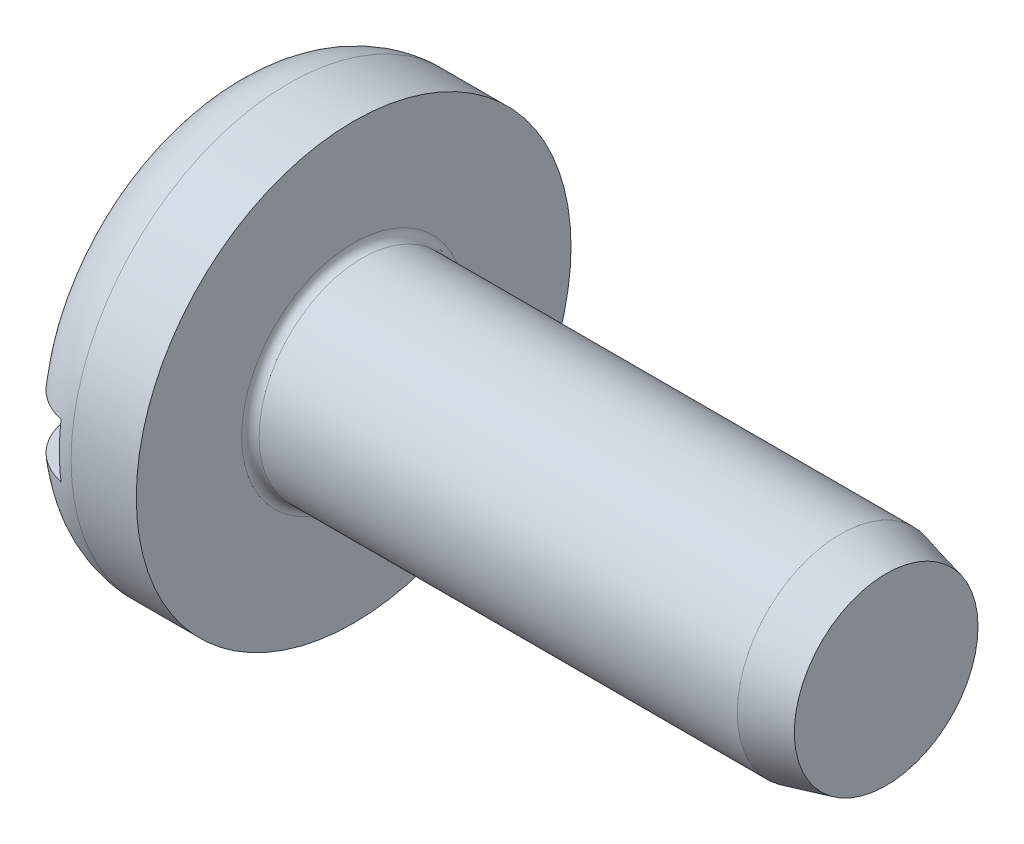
ISO-10303-21;
HEADER;
FILE_DESCRIPTION(('STEP AP214'),'2;1');
FILE_NAME('part.step','',(''),(''),'','','');
FILE_SCHEMA(('AUTOMOTIVE_DESIGN { 1 0 10303 214 1 1 1 1 }'));
ENDSEC;
DATA;
#1=APPLICATION_CONTEXT('core data for automotive mechanical design processes');
#2=APPLICATION_PROTOCOL_DEFINITION('international standard','automotive_design',2000,#1);
#3=PRODUCT_CONTEXT('',#1,'mechanical');
#4=PRODUCT('Part','Part','',(#3));
#5=PRODUCT_RELATED_PRODUCT_CATEGORY('part','',(#4));
#6=PRODUCT_DEFINITION_FORMATION('','',#4);
#7=PRODUCT_DEFINITION_CONTEXT('part definition',#1,'design');
#8=PRODUCT_DEFINITION('design','',#6,#7);
#9=PRODUCT_DEFINITION_SHAPE('','',#8);
#10=(LENGTH_UNIT() NAMED_UNIT(*) SI_UNIT(.MILLI.,.METRE.));
#11=(NAMED_UNIT(*) PLANE_ANGLE_UNIT() SI_UNIT($,.RADIAN.));
#12=(NAMED_UNIT(*) SI_UNIT($,.STERADIAN.) SOLID_ANGLE_UNIT());
#13=UNCERTAINTY_MEASURE_WITH_UNIT(LENGTH_MEASURE(1.E-05),#10,'distance_accuracy_value','');
#14=(GEOMETRIC_REPRESENTATION_CONTEXT(3) GLOBAL_UNCERTAINTY_ASSIGNED_CONTEXT((#13)) GLOBAL_UNIT_ASSIGNED_CONTEXT((#10,
#11,#12)) REPRESENTATION_CONTEXT('',''));
#15=CARTESIAN_POINT('',(0.,0.,0.));
#16=DIRECTION('',(0.,0.,1.));
#17=DIRECTION('',(1.,0.,0.));
#18=AXIS2_PLACEMENT_3D('',#15,#16,#17);
#19=CARTESIAN_POINT('',(-65.8851955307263,0.,0.));
#20=DIRECTION('',(-1.,0.,0.));
#21=DIRECTION('',(0.,0.,1.));
#22=AXIS2_PLACEMENT_3D('',#19,#20,#21);
#23=CYLINDRICAL_SURFACE('',#22,4.75);
#24=CARTESIAN_POINT('',(28.4,0.,0.));
#25=DIRECTION('',(1.,0.,0.));
#26=DIRECTION('',(0.,0.,-1.));
#27=AXIS2_PLACEMENT_3D('',#24,#25,#26);
#28=CIRCLE('',#27,4.75);
#29=CARTESIAN_POINT('',(28.4,0.,-4.75));
#30=VERTEX_POINT('',#29);
#31=EDGE_CURVE('E156',#30,#30,#28,.T.);
#32=ORIENTED_EDGE('',*,*,#31,.F.);
#33=EDGE_LOOP('',(#32));
#34=FACE_BOUND('',#33,.T.);
#35=CARTESIAN_POINT('',(6.4,0.,0.));
#36=DIRECTION('',(-1.,0.,0.));
#37=DIRECTION('',(0.,0.,1.));
#38=AXIS2_PLACEMENT_3D('',#35,#36,#37);
#39=CIRCLE('',#38,4.75);
#40=CARTESIAN_POINT('',(6.4,0.,4.75));
#41=VERTEX_POINT('',#40);
#42=EDGE_CURVE('E12',#41,#41,#39,.F.);
#43=ORIENTED_EDGE('',*,*,#42,.T.);
#44=EDGE_LOOP('',(#43));
#45=FACE_BOUND('',#44,.T.);
#46=ADVANCED_FACE('F38',(#34,#45),#23,.T.);
#47=CARTESIAN_POINT('',(0.,7.,0.));
#48=DIRECTION('',(1.,0.,0.));
#49=DIRECTION('',(0.,0.,-1.));
#50=AXIS2_PLACEMENT_3D('',#47,#48,#49);
#51=PLANE('',#50);
#52=CARTESIAN_POINT('',(0.,0.,0.));
#53=DIRECTION('',(-1.,0.,0.));
#54=DIRECTION('',(0.,0.,1.));
#55=AXIS2_PLACEMENT_3D('',#52,#53,#54);
#56=CIRCLE('',#55,7.00000000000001);
#57=CARTESIAN_POINT('',(0.,1.25,6.88748865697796));
#58=VERTEX_POINT('',#57);
#59=CARTESIAN_POINT('',(0.,1.25,-6.88748865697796));
#60=VERTEX_POINT('',#59);
#61=EDGE_CURVE('E165',#58,#60,#56,.T.);
#62=ORIENTED_EDGE('',*,*,#61,.T.);
#63=DIRECTION('',(0.,0.,1.));
#64=VECTOR('',#63,1.);
#65=CARTESIAN_POINT('',(0.,1.25,0.));
#66=LINE('',#65,#64);
#67=EDGE_CURVE('E180',#60,#58,#66,.T.);
#68=ORIENTED_EDGE('',*,*,#67,.T.);
#69=EDGE_LOOP('',(#62,#68));
#70=FACE_BOUND('',#69,.T.);
#71=ADVANCED_FACE('F127',(#70),#51,.F.);
#72=CARTESIAN_POINT('',(6.,4.74999999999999,0.));
#73=DIRECTION('',(-1.,0.,0.));
#74=DIRECTION('',(0.,0.,1.));
#75=AXIS2_PLACEMENT_3D('',#72,#73,#74);
#76=PLANE('',#75);
#77=CARTESIAN_POINT('',(6.,0.,0.));
#78=DIRECTION('',(-1.,0.,0.));
#79=DIRECTION('',(0.,0.,1.));
#80=AXIS2_PLACEMENT_3D('',#77,#78,#79);
#81=CIRCLE('',#80,5.15);
#82=CARTESIAN_POINT('',(6.,0.,5.15));
#83=VERTEX_POINT('',#82);
#84=EDGE_CURVE('E46',#83,#83,#81,.T.);
#85=ORIENTED_EDGE('',*,*,#84,.T.);
#86=EDGE_LOOP('',(#85));
#87=FACE_BOUND('',#86,.T.);
#88=CARTESIAN_POINT('',(6.00000000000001,0.,0.));
#89=DIRECTION('',(-1.,0.,0.));
#90=DIRECTION('',(0.,0.,1.));
#91=AXIS2_PLACEMENT_3D('',#88,#89,#90);
#92=CIRCLE('',#91,10.);
#93=CARTESIAN_POINT('',(6.00000000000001,0.,10.));
#94=VERTEX_POINT('',#93);
#95=EDGE_CURVE('E169',#94,#94,#92,.T.);
#96=ORIENTED_EDGE('',*,*,#95,.F.);
#97=EDGE_LOOP('',(#96));
#98=FACE_BOUND('',#97,.T.);
#99=ADVANCED_FACE('F134',(#87,#98),#76,.F.);
#100=CARTESIAN_POINT('',(-65.8851955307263,0.,0.));
#101=DIRECTION('',(-1.,0.,0.));
#102=DIRECTION('',(0.,0.,1.));
#103=AXIS2_PLACEMENT_3D('',#100,#101,#102);
#104=CYLINDRICAL_SURFACE('',#103,10.);
#105=CARTESIAN_POINT('',(3.,0.,0.));
#106=DIRECTION('',(-1.,0.,0.));
#107=DIRECTION('',(0.,0.,1.));
#108=AXIS2_PLACEMENT_3D('',#105,#106,#107);
#109=CIRCLE('',#108,10.);
#110=CARTESIAN_POINT('',(3.,0.,10.));
#111=VERTEX_POINT('',#110);
#112=EDGE_CURVE('E166',#111,#111,#109,.T.);
#113=ORIENTED_EDGE('',*,*,#112,.F.);
#114=EDGE_LOOP('',(#113));
#115=FACE_BOUND('',#114,.T.);
#116=ORIENTED_EDGE('',*,*,#95,.T.);
#117=EDGE_LOOP('',(#116));
#118=FACE_BOUND('',#117,.T.);
#119=ADVANCED_FACE('F132',(#115,#118),#104,.T.);
#120=CARTESIAN_POINT('',(3.,0.,0.));
#121=DIRECTION('',(-1.,0.,0.));
#122=DIRECTION('',(0.,0.,1.));
#123=AXIS2_PLACEMENT_3D('',#120,#121,#122);
#124=TOROIDAL_SURFACE('',#123,7.00000000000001,3.);
#125=CARTESIAN_POINT('',(2.4,0.,0.));
#126=DIRECTION('',(1.,0.,0.));
#127=DIRECTION('',(0.,0.,-1.));
#128=AXIS2_PLACEMENT_3D('',#125,#126,#127);
#129=CIRCLE('',#128,9.93938769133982);
#130=CARTESIAN_POINT('',(2.4,-1.25,-9.86047299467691));
#131=VERTEX_POINT('',#130);
#132=CARTESIAN_POINT('',(2.4,1.24999999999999,-9.86047299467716));
#133=VERTEX_POINT('',#132);
#134=EDGE_CURVE('E80',#131,#133,#129,.T.);
#135=ORIENTED_EDGE('',*,*,#134,.T.);
#136=CARTESIAN_POINT('',(1.34000910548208,1.24999999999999,-9.4162801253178));
#137=CARTESIAN_POINT('',(1.19938482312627,1.24999999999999,-9.32203535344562));
#138=CARTESIAN_POINT('',(1.06666473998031,1.24999999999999,-9.21576107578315));
#139=CARTESIAN_POINT('',(0.8209025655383,1.24999999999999,-8.98228972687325));
#140=CARTESIAN_POINT('',(0.707886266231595,1.24999999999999,-8.85506564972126));
#141=CARTESIAN_POINT('',(0.50486661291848,1.25,-8.58358751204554));
#142=CARTESIAN_POINT('',(0.414842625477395,1.25,-8.43934889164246));
#143=CARTESIAN_POINT('',(0.260103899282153,1.25,-8.13794333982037));
#144=CARTESIAN_POINT('',(0.195382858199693,1.25,-7.98077963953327));
#145=CARTESIAN_POINT('',(0.0924273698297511,1.25,-7.65663836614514));
#146=CARTESIAN_POINT('',(0.0544064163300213,1.25,-7.48959301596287));
#147=CARTESIAN_POINT('',(0.00653869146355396,1.25,-7.15151084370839));
#148=CARTESIAN_POINT('',(-0.00330508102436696,1.25,-6.98047359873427));
#149=CARTESIAN_POINT('',(0.00531125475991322,1.25,-6.63677787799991));
#150=CARTESIAN_POINT('',(0.0241596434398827,1.25,-6.46412915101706));
#151=CARTESIAN_POINT('',(0.0901670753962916,1.25,-6.12433094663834));
#152=CARTESIAN_POINT('',(0.137328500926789,1.25,-5.95718193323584));
#153=CARTESIAN_POINT('',(0.259379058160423,1.25,-5.6307192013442));
#154=CARTESIAN_POINT('',(0.334638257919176,1.25,-5.47154375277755));
#155=CARTESIAN_POINT('',(0.510681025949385,1.25,-5.16797482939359));
#156=CARTESIAN_POINT('',(0.611466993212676,1.25,-5.02358274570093));
#157=CARTESIAN_POINT('',(0.836398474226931,1.24999999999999,-4.75312345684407));
#158=CARTESIAN_POINT('',(0.960651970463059,1.24999999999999,-4.62714593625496));
#159=CARTESIAN_POINT('',(1.22890706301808,1.24999999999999,-4.39829870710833));
#160=CARTESIAN_POINT('',(1.37290756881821,1.24999999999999,-4.2954277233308));
#161=CARTESIAN_POINT('',(1.67379323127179,1.24999999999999,-4.11816697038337));
#162=CARTESIAN_POINT('',(1.83037804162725,1.24999999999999,-4.04326844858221));
#163=CARTESIAN_POINT('',(2.15428315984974,1.24999999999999,-3.92221914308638));
#164=CARTESIAN_POINT('',(2.32159933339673,1.24999999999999,-3.87605736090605));
#165=CARTESIAN_POINT('',(2.65428345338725,1.24999999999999,-3.81591452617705));
#166=CARTESIAN_POINT('',(2.81941113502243,1.24999999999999,-3.80060236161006));
#167=CARTESIAN_POINT('',(3.14980632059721,1.24999999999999,-3.79882284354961));
#168=CARTESIAN_POINT('',(3.31507379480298,1.24999999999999,-3.81235041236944));
#169=CARTESIAN_POINT('',(3.63619181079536,1.24999999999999,-3.86683910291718));
#170=CARTESIAN_POINT('',(3.7921764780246,1.24999999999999,-3.90701713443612));
#171=CARTESIAN_POINT('',(4.09543301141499,1.24999999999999,-4.01241024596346));
#172=CARTESIAN_POINT('',(4.24270375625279,1.24999999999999,-4.0776285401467));
#173=CARTESIAN_POINT('',(4.52808379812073,1.24999999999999,-4.23255845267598));
#174=CARTESIAN_POINT('',(4.66590822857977,1.24999999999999,-4.32279384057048));
#175=CARTESIAN_POINT('',(4.92530718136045,1.24999999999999,-4.52418568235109));
#176=CARTESIAN_POINT('',(5.04687848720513,1.24999999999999,-4.63534626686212));
#177=CARTESIAN_POINT('',(5.27593756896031,1.24999999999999,-4.88081695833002));
#178=CARTESIAN_POINT('',(5.38255824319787,1.24999999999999,-5.01593690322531));
#179=CARTESIAN_POINT('',(5.57228450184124,1.24999999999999,-5.30178997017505));
#180=CARTESIAN_POINT('',(5.65538672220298,1.24999999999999,-5.45252532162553));
#181=CARTESIAN_POINT('',(5.79766427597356,1.24999999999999,-5.76952816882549));
#182=CARTESIAN_POINT('',(5.8561791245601,1.24999999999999,-5.93609268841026));
#183=CARTESIAN_POINT('',(5.94441985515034,1.24999999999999,-6.27668772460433));
#184=CARTESIAN_POINT('',(5.97414513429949,1.24999999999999,-6.45071839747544));
#185=CARTESIAN_POINT('',(6.00377819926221,1.24999999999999,-6.80129990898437));
#186=CARTESIAN_POINT('',(6.00368812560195,1.24999999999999,-6.9778505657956));
#187=CARTESIAN_POINT('',(5.9734732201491,1.24999999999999,-7.3283682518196));
#188=CARTESIAN_POINT('',(5.94335011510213,1.24999999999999,-7.50233542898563));
#189=CARTESIAN_POINT('',(5.85430026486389,1.24999999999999,-7.84039370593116));
#190=CARTESIAN_POINT('',(5.79574114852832,1.24999999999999,-8.00458161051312));
#191=CARTESIAN_POINT('',(5.65149606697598,1.24999999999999,-8.32057883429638));
#192=CARTESIAN_POINT('',(5.56581209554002,1.24999999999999,-8.4723890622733));
#193=CARTESIAN_POINT('',(5.3710824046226,1.24999999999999,-8.75703011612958));
#194=CARTESIAN_POINT('',(5.2623865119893,1.24999999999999,-8.89010030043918));
#195=CARTESIAN_POINT('',(5.02396443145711,1.24999999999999,-9.13583952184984));
#196=CARTESIAN_POINT('',(4.89423955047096,1.24999999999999,-9.24850982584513));
#197=CARTESIAN_POINT('',(4.61903789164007,1.24999999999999,-9.44892981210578));
#198=CARTESIAN_POINT('',(4.47375566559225,1.24999999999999,-9.53694669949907));
#199=CARTESIAN_POINT('',(4.1703991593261,1.24999999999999,-9.68712710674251));
#200=CARTESIAN_POINT('',(4.0123259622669,1.24999999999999,-9.74929281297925));
#201=CARTESIAN_POINT('',(3.68914000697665,1.24999999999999,-9.84556612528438));
#202=CARTESIAN_POINT('',(3.5240883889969,1.24999999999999,-9.87987908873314));
#203=CARTESIAN_POINT('',(3.19051750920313,1.24999999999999,-9.92021027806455));
#204=CARTESIAN_POINT('',(3.02199745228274,1.24999999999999,-9.92622194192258));
#205=CARTESIAN_POINT('',(2.68685940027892,1.24999999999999,-9.90978915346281));
#206=CARTESIAN_POINT('',(2.52023730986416,1.24999999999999,-9.88742706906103));
#207=CARTESIAN_POINT('',(2.19326187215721,1.24999999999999,-9.81505031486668));
#208=CARTESIAN_POINT('',(2.03290098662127,1.24999999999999,-9.7650700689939));
#209=CARTESIAN_POINT('',(1.78372332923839,1.24999999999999,-9.66376463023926));
#210=CARTESIAN_POINT('',(1.69148740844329,1.24999999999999,-9.62063518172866));
#211=CARTESIAN_POINT('',(1.51188579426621,1.24999999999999,-9.52521206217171));
#212=CARTESIAN_POINT('',(1.42452008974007,1.24999999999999,-9.47291841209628));
#213=CARTESIAN_POINT('',(1.34000910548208,1.24999999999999,-9.4162801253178));
#214=B_SPLINE_CURVE_WITH_KNOTS('',3,(#136,#137,#138,#139,#140,#141,#142,#143,#144,#145,#146,
#147,#148,#149,#150,#151,#152,#153,#154,#155,#156,#157,#158,#159,#160,#161,#162,#163,#164,#165,
#166,#167,#168,#169,#170,#171,#172,#173,#174,#175,#176,#177,#178,#179,#180,#181,#182,#183,#184,
#185,#186,#187,#188,#189,#190,#191,#192,#193,#194,#195,#196,#197,#198,#199,#200,#201,#202,#203,
#204,#205,#206,#207,#208,#209,#210,#211,#212,#213),.UNSPECIFIED.,.T.,.F.,(4,2,2,2,2,2,2,2,2,2,2,
2,2,2,2,2,2,2,2,2,2,2,2,2,2,2,2,2,2,2,2,2,2,2,2,2,2,2,4),(0.,0.507477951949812,1.01561527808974,
1.52329498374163,2.03084815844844,2.54241488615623,3.05403605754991,3.57264261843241,
4.09129282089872,4.61702989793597,5.14281640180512,5.67108393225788,6.19932230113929,
6.71742203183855,7.23532334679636,7.73035356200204,8.22529662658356,8.70630500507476,
9.18737514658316,9.67939636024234,10.1715148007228,10.6855254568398,11.199609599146,
11.7267355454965,12.2538725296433,12.7809716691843,13.3080405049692,13.8284696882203,
14.3488606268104,14.8618456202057,15.3747987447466,15.8819557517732,16.3890698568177,
16.8924101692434,17.3958671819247,17.8978660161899,18.3992405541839,18.7042203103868,
19.0091993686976),.UNSPECIFIED.);
#215=EDGE_CURVE('E100',#133,#60,#214,.T.);
#216=ORIENTED_EDGE('',*,*,#215,.T.);
#217=ORIENTED_EDGE('',*,*,#61,.F.);
#218=CARTESIAN_POINT('',(1.33942751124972,1.24999999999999,4.32446622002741));
#219=CARTESIAN_POINT('',(1.19606436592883,1.24999999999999,4.4236587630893));
#220=CARTESIAN_POINT('',(1.06113411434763,1.24999999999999,4.53531090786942));
#221=CARTESIAN_POINT('',(0.811850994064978,1.24999999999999,4.77984923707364));
#222=CARTESIAN_POINT('',(0.697533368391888,1.25,4.91277106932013));
#223=CARTESIAN_POINT('',(0.492776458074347,1.25,5.19562467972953));
#224=CARTESIAN_POINT('',(0.402305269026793,1.25,5.34553334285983));
#225=CARTESIAN_POINT('',(0.247526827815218,1.25,5.65822119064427));
#226=CARTESIAN_POINT('',(0.183209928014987,1.25,5.82099560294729));
#227=CARTESIAN_POINT('',(0.0819775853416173,1.25,6.15682052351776));
#228=CARTESIAN_POINT('',(0.0453706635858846,1.25,6.32996421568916));
#229=CARTESIAN_POINT('',(0.00194678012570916,1.25,6.67996793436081));
#230=CARTESIAN_POINT('',(-0.00486855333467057,1.25,6.8568281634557));
#231=CARTESIAN_POINT('',(0.0116532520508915,1.25,7.20797093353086));
#232=CARTESIAN_POINT('',(0.034791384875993,1.25,7.38226278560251));
#233=CARTESIAN_POINT('',(0.110430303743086,1.25,7.72435802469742));
#234=CARTESIAN_POINT('',(0.16292887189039,1.25,7.89216190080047));
#235=CARTESIAN_POINT('',(0.295001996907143,1.25,8.21398383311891));
#236=CARTESIAN_POINT('',(0.374183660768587,1.25,8.36816312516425));
#237=CARTESIAN_POINT('',(0.557644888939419,1.25,8.66078951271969));
#238=CARTESIAN_POINT('',(0.661922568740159,1.25,8.79923778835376));
#239=CARTESIAN_POINT('',(0.891090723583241,1.24999999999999,9.05452042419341));
#240=CARTESIAN_POINT('',(1.01568660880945,1.24999999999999,9.17161928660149));
#241=CARTESIAN_POINT('',(1.28293788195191,1.24999999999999,9.38298488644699));
#242=CARTESIAN_POINT('',(1.42559227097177,1.24999999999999,9.47725288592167));
#243=CARTESIAN_POINT('',(1.72339085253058,1.24999999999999,9.63933556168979));
#244=CARTESIAN_POINT('',(1.8783986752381,1.24999999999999,9.70740086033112));
#245=CARTESIAN_POINT('',(2.19768418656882,1.24999999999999,9.8163693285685));
#246=CARTESIAN_POINT('',(2.36196153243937,1.24999999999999,9.85727350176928));
#247=CARTESIAN_POINT('',(2.69410004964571,1.24999999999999,9.9105516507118));
#248=CARTESIAN_POINT('',(2.86193495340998,1.24999999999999,9.92308949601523));
#249=CARTESIAN_POINT('',(3.19732041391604,1.24999999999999,9.91975041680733));
#250=CARTESIAN_POINT('',(3.36487097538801,1.24999999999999,9.90387396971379));
#251=CARTESIAN_POINT('',(3.69459763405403,1.24999999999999,9.84423178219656));
#252=CARTESIAN_POINT('',(3.8567834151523,1.24999999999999,9.80051954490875));
#253=CARTESIAN_POINT('',(4.17153333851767,1.24999999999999,9.68653492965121));
#254=CARTESIAN_POINT('',(4.3240974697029,1.24999999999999,9.6162625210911));
#255=CARTESIAN_POINT('',(4.61559532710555,1.24999999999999,9.45105008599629));
#256=CARTESIAN_POINT('',(4.7545034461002,1.24999999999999,9.35606489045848));
#257=CARTESIAN_POINT('',(5.01451254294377,1.24999999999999,9.14424314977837));
#258=CARTESIAN_POINT('',(5.13561317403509,1.24999999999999,9.02740617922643));
#259=CARTESIAN_POINT('',(5.35733296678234,1.24999999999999,8.77451918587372));
#260=CARTESIAN_POINT('',(5.45783251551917,1.24999999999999,8.63836431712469));
#261=CARTESIAN_POINT('',(5.63479490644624,1.24999999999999,8.35124620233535));
#262=CARTESIAN_POINT('',(5.71125681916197,1.24999999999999,8.20028238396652));
#263=CARTESIAN_POINT('',(5.83878957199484,1.24999999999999,7.88630563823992));
#264=CARTESIAN_POINT('',(5.88961083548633,1.24999999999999,7.72319136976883));
#265=CARTESIAN_POINT('',(5.96353241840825,1.24999999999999,7.39080308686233));
#266=CARTESIAN_POINT('',(5.9866310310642,1.24999999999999,7.22152869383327));
#267=CARTESIAN_POINT('',(6.00479247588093,1.24999999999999,6.87926829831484));
#268=CARTESIAN_POINT('',(5.99948539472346,1.24999999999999,6.70626268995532));
#269=CARTESIAN_POINT('',(5.96032808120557,1.24999999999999,6.36351399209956));
#270=CARTESIAN_POINT('',(5.92647553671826,1.24999999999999,6.19377116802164));
#271=CARTESIAN_POINT('',(5.83063145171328,1.24999999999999,5.8598105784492));
#272=CARTESIAN_POINT('',(5.76824736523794,1.24999999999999,5.69570541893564));
#273=CARTESIAN_POINT('',(5.61703915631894,1.24999999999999,5.38015072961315));
#274=CARTESIAN_POINT('',(5.52821243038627,1.24999999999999,5.22870244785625));
#275=CARTESIAN_POINT('',(5.32571669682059,1.24999999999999,4.94158680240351));
#276=CARTESIAN_POINT('',(5.21185380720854,1.24999999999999,4.8060560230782));
#277=CARTESIAN_POINT('',(4.96273601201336,1.24999999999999,4.55628984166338));
#278=CARTESIAN_POINT('',(4.82748080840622,1.24999999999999,4.44205473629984));
#279=CARTESIAN_POINT('',(4.54099242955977,1.24999999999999,4.23995428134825));
#280=CARTESIAN_POINT('',(4.38997665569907,1.24999999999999,4.15178136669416));
#281=CARTESIAN_POINT('',(4.07483329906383,1.24999999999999,4.00327571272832));
#282=CARTESIAN_POINT('',(3.91071069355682,1.24999999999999,3.94293246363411));
#283=CARTESIAN_POINT('',(3.58111141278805,1.24999999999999,3.85451239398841));
#284=CARTESIAN_POINT('',(3.41595899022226,1.24999999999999,3.82522736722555));
#285=CARTESIAN_POINT('',(3.08304562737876,1.24999999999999,3.79599403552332));
#286=CARTESIAN_POINT('',(2.91528468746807,1.24999999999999,3.79604572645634));
#287=CARTESIAN_POINT('',(2.58847406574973,1.24999999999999,3.82493058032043));
#288=CARTESIAN_POINT('',(2.4293296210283,1.24999999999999,3.85271561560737));
#289=CARTESIAN_POINT('',(2.11801687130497,1.24999999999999,3.93432186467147));
#290=CARTESIAN_POINT('',(1.96584070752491,1.24999999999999,3.98811291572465));
#291=CARTESIAN_POINT('',(1.73523413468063,1.24999999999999,4.0914278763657));
#292=CARTESIAN_POINT('',(1.65310801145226,1.24999999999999,4.13293094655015));
#293=CARTESIAN_POINT('',(1.49301513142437,1.24999999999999,4.22328943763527));
#294=CARTESIAN_POINT('',(1.41504817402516,1.24999999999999,4.27214450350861));
#295=CARTESIAN_POINT('',(1.33942751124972,1.24999999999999,4.32446622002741));
#296=B_SPLINE_CURVE_WITH_KNOTS('',3,(#218,#219,#220,#221,#222,#223,#224,#225,#226,#227,#228,
#229,#230,#231,#232,#233,#234,#235,#236,#237,#238,#239,#240,#241,#242,#243,#244,#245,#246,#247,
#248,#249,#250,#251,#252,#253,#254,#255,#256,#257,#258,#259,#260,#261,#262,#263,#264,#265,#266,
#267,#268,#269,#270,#271,#272,#273,#274,#275,#276,#277,#278,#279,#280,#281,#282,#283,#284,#285,
#286,#287,#288,#289,#290,#291,#292,#293,#294,#295),.UNSPECIFIED.,.T.,.F.,(4,2,2,2,2,2,2,2,2,2,2,
2,2,2,2,2,2,2,2,2,2,2,2,2,2,2,2,2,2,2,2,2,2,2,2,2,2,2,4),(0.,0.522654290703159,1.04619390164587,
1.56902946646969,2.0916719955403,2.62005130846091,3.14845949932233,3.67337498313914,
4.19825082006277,4.715713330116,5.23313699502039,5.74363482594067,6.25410443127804,
6.759562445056,7.26500178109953,7.76751370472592,8.27001718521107,8.77155770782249,
9.27309880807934,9.77556312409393,10.2780372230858,10.783350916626,11.2886841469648,
11.7988455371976,12.3090383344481,12.8258911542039,13.3427858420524,13.8670165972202,
14.3912989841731,14.9197941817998,15.4482967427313,15.9702875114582,16.4920809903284,
16.9927343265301,17.493387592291,17.9758098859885,18.4576739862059,18.7333750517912,
19.0090628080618),.UNSPECIFIED.);
#297=CARTESIAN_POINT('',(2.4,1.24999999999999,9.86047299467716));
#298=VERTEX_POINT('',#297);
#299=EDGE_CURVE('E97',#58,#298,#296,.T.);
#300=ORIENTED_EDGE('',*,*,#299,.T.);
#301=CARTESIAN_POINT('',(2.4,-1.25,9.86047299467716));
#302=VERTEX_POINT('',#301);
#303=EDGE_CURVE('E61',#298,#302,#129,.T.);
#304=ORIENTED_EDGE('',*,*,#303,.T.);
#305=CARTESIAN_POINT('',(1.33942751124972,-1.25,4.32446622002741));
#306=CARTESIAN_POINT('',(1.47489240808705,-1.25,4.23075290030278));
#307=CARTESIAN_POINT('',(1.6180700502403,-1.25,4.14802938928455));
#308=CARTESIAN_POINT('',(1.91626319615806,-1.25,4.00743156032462));
#309=CARTESIAN_POINT('',(2.07128657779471,-1.25,3.94957395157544));
#310=CARTESIAN_POINT('',(2.38915814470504,-1.25,3.86096160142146));
#311=CARTESIAN_POINT('',(2.55201631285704,-1.25,3.83024245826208));
#312=CARTESIAN_POINT('',(2.88055622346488,-1.25,3.79740370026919));
#313=CARTESIAN_POINT('',(3.04623707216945,-1.25,3.79527519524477));
#314=CARTESIAN_POINT('',(3.37138703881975,-1.25,3.81938298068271));
#315=CARTESIAN_POINT('',(3.5309085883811,-1.25,3.84492113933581));
#316=CARTESIAN_POINT('',(3.84347062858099,-1.25,3.92218521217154));
#317=CARTESIAN_POINT('',(3.99651036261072,-1.25,3.97391417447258));
#318=CARTESIAN_POINT('',(4.29346105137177,-1.25,4.10217961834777));
#319=CARTESIAN_POINT('',(4.43727475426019,-1.25,4.17894057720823));
#320=CARTESIAN_POINT('',(4.71071399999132,-1.24999999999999,4.35453880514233));
#321=CARTESIAN_POINT('',(4.84033688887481,-1.24999999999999,4.45338019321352));
#322=CARTESIAN_POINT('',(5.08767735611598,-1.24999999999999,4.67497007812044));
#323=CARTESIAN_POINT('',(5.2046300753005,-1.24999999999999,4.79857262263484));
#324=CARTESIAN_POINT('',(5.41694113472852,-1.24999999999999,5.06311188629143));
#325=CARTESIAN_POINT('',(5.51229580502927,-1.24999999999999,5.20405154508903));
#326=CARTESIAN_POINT('',(5.68174707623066,-1.24999999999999,5.5043371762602));
#327=CARTESIAN_POINT('',(5.75504401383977,-1.24999999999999,5.6641351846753));
#328=CARTESIAN_POINT('',(5.87395978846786,-1.24999999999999,5.99372509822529));
#329=CARTESIAN_POINT('',(5.91957714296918,-1.24999999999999,6.16351753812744));
#330=CARTESIAN_POINT('',(5.98189886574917,-1.24999999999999,6.50938867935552));
#331=CARTESIAN_POINT('',(5.99842933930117,-1.24999999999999,6.68549880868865));
#332=CARTESIAN_POINT('',(6.00135668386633,-1.24999999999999,7.03797541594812));
#333=CARTESIAN_POINT('',(5.98775482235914,-1.24999999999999,7.21434188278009));
#334=CARTESIAN_POINT('',(5.93089308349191,-1.24999999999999,7.5603280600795));
#335=CARTESIAN_POINT('',(5.88794647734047,-1.24999999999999,7.72999920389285));
#336=CARTESIAN_POINT('',(5.7737570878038,-1.24999999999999,8.05954083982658));
#337=CARTESIAN_POINT('',(5.70251640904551,-1.24999999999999,8.21941205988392));
#338=CARTESIAN_POINT('',(5.53488396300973,-1.24999999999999,8.52235347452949));
#339=CARTESIAN_POINT('',(5.43887086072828,-1.24999999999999,8.66563322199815));
#340=CARTESIAN_POINT('',(5.22387263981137,-1.24999999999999,8.93377648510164));
#341=CARTESIAN_POINT('',(5.10488910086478,-1.24999999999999,9.0586412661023));
#342=CARTESIAN_POINT('',(4.84892636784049,-1.24999999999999,9.28480174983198));
#343=CARTESIAN_POINT('',(4.71218695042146,-1.24999999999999,9.38636888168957));
#344=CARTESIAN_POINT('',(4.42347883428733,-1.25,9.56487314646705));
#345=CARTESIAN_POINT('',(4.27151089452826,-1.25,9.64181150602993));
#346=CARTESIAN_POINT('',(3.95804988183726,-1.25,9.76822502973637));
#347=CARTESIAN_POINT('',(3.79664817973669,-1.25,9.81792683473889));
#348=CARTESIAN_POINT('',(3.46777432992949,-1.25,9.88939216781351));
#349=CARTESIAN_POINT('',(3.30030236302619,-1.25,9.91115652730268));
#350=CARTESIAN_POINT('',(2.96484026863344,-1.25,9.92607075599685));
#351=CARTESIAN_POINT('',(2.79685577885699,-1.25,9.9193477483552));
#352=CARTESIAN_POINT('',(2.46440618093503,-1.25,9.87777386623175));
#353=CARTESIAN_POINT('',(2.29994103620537,-1.25,9.84292328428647));
#354=CARTESIAN_POINT('',(1.97929729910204,-1.25,9.74614768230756));
#355=CARTESIAN_POINT('',(1.82311348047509,-1.25,9.6842399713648));
#356=CARTESIAN_POINT('',(1.52331262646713,-1.25,9.53516041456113));
#357=CARTESIAN_POINT('',(1.37969567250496,-1.25,9.44798840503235));
#358=CARTESIAN_POINT('',(1.10860103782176,-1.25,9.25059766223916));
#359=CARTESIAN_POINT('',(0.981175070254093,-1.25,9.14030792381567));
#360=CARTESIAN_POINT('',(0.746493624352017,-1.25,8.90003376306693));
#361=CARTESIAN_POINT('',(0.639238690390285,-1.25,8.7700488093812));
#362=CARTESIAN_POINT('',(0.447111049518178,-1.25,8.49312977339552));
#363=CARTESIAN_POINT('',(0.362399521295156,-1.25,8.34608389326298));
#364=CARTESIAN_POINT('',(0.218567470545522,-1.25,8.03997329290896));
#365=CARTESIAN_POINT('',(0.159448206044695,-1.25,7.88090798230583));
#366=CARTESIAN_POINT('',(0.0677605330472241,-1.25,7.55343976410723));
#367=CARTESIAN_POINT('',(0.0354873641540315,-1.25,7.38495422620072));
#368=CARTESIAN_POINT('',(-0.000729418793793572,-1.25,7.04497635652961));
#369=CARTESIAN_POINT('',(-0.00467219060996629,-1.25,6.87348393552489));
#370=CARTESIAN_POINT('',(0.0158161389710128,-1.25,6.52983312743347));
#371=CARTESIAN_POINT('',(0.0406388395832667,-1.25,6.35769810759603));
#372=CARTESIAN_POINT('',(0.118446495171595,-1.25,6.01986739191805));
#373=CARTESIAN_POINT('',(0.171440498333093,-1.25,5.85417378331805));
#374=CARTESIAN_POINT('',(0.304936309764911,-1.25,5.53160375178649));
#375=CARTESIAN_POINT('',(0.38580562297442,-1.25,5.37487952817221));
#376=CARTESIAN_POINT('',(0.572578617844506,-1.25,5.07728165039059));
#377=CARTESIAN_POINT('',(0.678456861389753,-1.25,4.93639210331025));
#378=CARTESIAN_POINT('',(0.876198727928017,-1.25,4.71497935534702));
#379=CARTESIAN_POINT('',(0.962304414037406,-1.25,4.62924438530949));
#380=CARTESIAN_POINT('',(1.14402066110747,-1.25,4.46850693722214));
#381=CARTESIAN_POINT('',(1.2396311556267,-1.25,4.39350438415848));
#382=CARTESIAN_POINT('',(1.33942751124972,-1.25,4.32446622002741));
#383=B_SPLINE_CURVE_WITH_KNOTS('',3,(#305,#306,#307,#308,#309,#310,#311,#312,#313,#314,#315,
#316,#317,#318,#319,#320,#321,#322,#323,#324,#325,#326,#327,#328,#329,#330,#331,#332,#333,#334,
#335,#336,#337,#338,#339,#340,#341,#342,#343,#344,#345,#346,#347,#348,#349,#350,#351,#352,#353,
#354,#355,#356,#357,#358,#359,#360,#361,#362,#363,#364,#365,#366,#367,#368,#369,#370,#371,#372,
#373,#374,#375,#376,#377,#378,#379,#380,#381,#382),.UNSPECIFIED.,.T.,.F.,(4,2,2,2,2,2,2,2,2,2,2,
2,2,2,2,2,2,2,2,2,2,2,2,2,2,2,2,2,2,2,2,2,2,2,2,2,2,2,4),(0.,0.493745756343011,
0.987822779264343,1.48254693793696,1.97711725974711,2.45949234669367,2.94192358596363,
3.42880586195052,3.9157790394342,4.42397123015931,4.93224970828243,5.45719625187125,
5.98217090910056,6.51027357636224,7.03835403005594,7.56088324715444,8.08337360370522,
8.59830712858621,9.1132052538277,9.62175957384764,10.130288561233,10.6345191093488,
11.1387346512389,11.640702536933,12.1426652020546,12.6443072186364,13.1459524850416,
13.6491617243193,14.1523845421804,14.6591140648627,15.1658684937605,15.6781249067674,
16.190396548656,16.7097247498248,17.2292198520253,17.7558438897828,18.2819345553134,
18.6456772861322,19.0094174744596),.UNSPECIFIED.);
#384=CARTESIAN_POINT('',(0.,-1.25,6.88748865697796));
#385=VERTEX_POINT('',#384);
#386=EDGE_CURVE('E89',#302,#385,#383,.T.);
#387=ORIENTED_EDGE('',*,*,#386,.T.);
#388=CARTESIAN_POINT('',(0.,-1.25,-6.88748865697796));
#389=VERTEX_POINT('',#388);
#390=EDGE_CURVE('E96',#389,#385,#56,.T.);
#391=ORIENTED_EDGE('',*,*,#390,.F.);
#392=CARTESIAN_POINT('',(1.34000910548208,-1.25,-9.4162801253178));
#393=CARTESIAN_POINT('',(1.47920877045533,-1.25,-9.5095518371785));
#394=CARTESIAN_POINT('',(1.62635527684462,-1.25,-9.59117533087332));
#395=CARTESIAN_POINT('',(1.93237729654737,-1.25,-9.72864046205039));
#396=CARTESIAN_POINT('',(2.09126594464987,-1.25,-9.7844527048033));
#397=CARTESIAN_POINT('',(2.41612962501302,-1.25,-9.86855619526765));
#398=CARTESIAN_POINT('',(2.58210234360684,-1.25,-9.89685635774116));
#399=CARTESIAN_POINT('',(2.91640075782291,-1.25,-9.92511733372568));
#400=CARTESIAN_POINT('',(3.08472588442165,-1.25,-9.92508488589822));
#401=CARTESIAN_POINT('',(3.41864903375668,-1.25,-9.89672974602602));
#402=CARTESIAN_POINT('',(3.58425167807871,-1.25,-9.86846145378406));
#403=CARTESIAN_POINT('',(3.90837054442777,-1.25,-9.78454283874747));
#404=CARTESIAN_POINT('',(4.06688654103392,-1.25,-9.72889164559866));
#405=CARTESIAN_POINT('',(4.3724771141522,-1.25,-9.59177877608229));
#406=CARTESIAN_POINT('',(4.51954270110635,-1.24999999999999,-9.51029707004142));
#407=CARTESIAN_POINT('',(4.79798629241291,-1.24999999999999,-9.32390597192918));
#408=CARTESIAN_POINT('',(4.9293640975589,-1.24999999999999,-9.21899628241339));
#409=CARTESIAN_POINT('',(5.17337501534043,-1.24999999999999,-8.98824419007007));
#410=CARTESIAN_POINT('',(5.28591960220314,-1.24999999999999,-8.86230819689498));
#411=CARTESIAN_POINT('',(5.48847566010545,-1.24999999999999,-8.59346575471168));
#412=CARTESIAN_POINT('',(5.57848642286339,-1.24999999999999,-8.45055877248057));
#413=CARTESIAN_POINT('',(5.73427020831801,-1.24999999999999,-8.15055653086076));
#414=CARTESIAN_POINT('',(5.79983152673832,-1.24999999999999,-7.9933513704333));
#415=CARTESIAN_POINT('',(5.90398226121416,-1.24999999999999,-7.67025230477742));
#416=CARTESIAN_POINT('',(5.942570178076,-1.24999999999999,-7.50435791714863));
#417=CARTESIAN_POINT('',(5.9922079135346,-1.24999999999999,-7.16643537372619));
#418=CARTESIAN_POINT('',(6.002916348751,-1.24999999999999,-6.99435710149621));
#419=CARTESIAN_POINT('',(5.99572430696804,-1.24999999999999,-6.65080255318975));
#420=CARTESIAN_POINT('',(5.97782163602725,-1.24999999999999,-6.47932632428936));
#421=CARTESIAN_POINT('',(5.91362156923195,-1.24999999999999,-6.13922710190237));
#422=CARTESIAN_POINT('',(5.86692100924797,-1.24999999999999,-5.97068019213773));
#423=CARTESIAN_POINT('',(5.74620054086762,-1.24999999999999,-5.64366414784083));
#424=CARTESIAN_POINT('',(5.67217807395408,-1.24999999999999,-5.48519595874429));
#425=CARTESIAN_POINT('',(5.4979258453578,-1.24999999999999,-5.1810689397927));
#426=CARTESIAN_POINT('',(5.39741881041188,-1.24999999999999,-5.0355688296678));
#427=CARTESIAN_POINT('',(5.17329436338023,-1.24999999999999,-4.76357694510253));
#428=CARTESIAN_POINT('',(5.04967549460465,-1.24999999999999,-4.63708636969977));
#429=CARTESIAN_POINT('',(4.78328478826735,-1.24999999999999,-4.40766370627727));
#430=CARTESIAN_POINT('',(4.64061256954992,-1.24999999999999,-4.30461615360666));
#431=CARTESIAN_POINT('',(4.33951096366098,-1.25,-4.12489705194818));
#432=CARTESIAN_POINT('',(4.18108533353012,-1.25,-4.04821923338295));
#433=CARTESIAN_POINT('',(3.85859539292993,-1.25,-3.92642475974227));
#434=CARTESIAN_POINT('',(3.69489965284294,-1.25,-3.8803338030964));
#435=CARTESIAN_POINT('',(3.36196599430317,-1.25,-3.81770636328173));
#436=CARTESIAN_POINT('',(3.1927300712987,-1.25,-3.8011593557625));
#437=CARTESIAN_POINT('',(2.86139241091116,-1.25,-3.79843507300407));
#438=CARTESIAN_POINT('',(2.69929983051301,-1.25,-3.81097086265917));
#439=CARTESIAN_POINT('',(2.37956646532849,-1.25,-3.86321453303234));
#440=CARTESIAN_POINT('',(2.2219257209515,-1.25,-3.90292266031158));
#441=CARTESIAN_POINT('',(1.9160173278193,-1.25,-4.00769001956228));
#442=CARTESIAN_POINT('',(1.7677162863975,-1.25,-4.07265218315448));
#443=CARTESIAN_POINT('',(1.48352763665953,-1.25,-4.22561756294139));
#444=CARTESIAN_POINT('',(1.34764223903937,-1.25,-4.31362487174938));
#445=CARTESIAN_POINT('',(1.08637648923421,-1.25,-4.51386380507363));
#446=CARTESIAN_POINT('',(0.961626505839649,-1.25,-4.62691773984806));
#447=CARTESIAN_POINT('',(0.731992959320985,-1.25,-4.8716657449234));
#448=CARTESIAN_POINT('',(0.627113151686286,-1.25,-5.00336333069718));
#449=CARTESIAN_POINT('',(0.436177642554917,-1.25,-5.28719007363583));
#450=CARTESIAN_POINT('',(0.350996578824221,-1.25,-5.43990850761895));
#451=CARTESIAN_POINT('',(0.207123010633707,-1.25,-5.7573582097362));
#452=CARTESIAN_POINT('',(0.148432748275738,-1.25,-5.92209049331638));
#453=CARTESIAN_POINT('',(0.0587243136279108,-1.25,-6.26105047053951));
#454=CARTESIAN_POINT('',(0.0280450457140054,-1.25,-6.43536807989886));
#455=CARTESIAN_POINT('',(-0.00336204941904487,-1.25,-6.78668087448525));
#456=CARTESIAN_POINT('',(-0.00409179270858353,-1.25,-6.96367588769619));
#457=CARTESIAN_POINT('',(0.0245198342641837,-1.25,-7.31379320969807));
#458=CARTESIAN_POINT('',(0.0536196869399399,-1.25,-7.48693520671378));
#459=CARTESIAN_POINT('',(0.140916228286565,-1.25,-7.82577744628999));
#460=CARTESIAN_POINT('',(0.199118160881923,-1.25,-7.99147634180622));
#461=CARTESIAN_POINT('',(0.342086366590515,-1.25,-8.30820924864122));
#462=CARTESIAN_POINT('',(0.426474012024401,-1.25,-8.45941442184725));
#463=CARTESIAN_POINT('',(0.619706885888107,-1.25,-8.74511054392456));
#464=CARTESIAN_POINT('',(0.728520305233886,-1.25,-8.87962288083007));
#465=CARTESIAN_POINT('',(0.922285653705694,-1.25,-9.08106456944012));
#466=CARTESIAN_POINT('',(1.0007496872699,-1.25,-9.15434404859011));
#467=CARTESIAN_POINT('',(1.16506018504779,-1.25,-9.29209991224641));
#468=CARTESIAN_POINT('',(1.25090659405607,-1.25,-9.35657636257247));
#469=CARTESIAN_POINT('',(1.34000910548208,-1.25,-9.4162801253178));
#470=B_SPLINE_CURVE_WITH_KNOTS('',3,(#392,#393,#394,#395,#396,#397,#398,#399,#400,#401,#402,
#403,#404,#405,#406,#407,#408,#409,#410,#411,#412,#413,#414,#415,#416,#417,#418,#419,#420,#421,
#422,#423,#424,#425,#426,#427,#428,#429,#430,#431,#432,#433,#434,#435,#436,#437,#438,#439,#440,
#441,#442,#443,#444,#445,#446,#447,#448,#449,#450,#451,#452,#453,#454,#455,#456,#457,#458,#459,
#460,#461,#462,#463,#464,#465,#466,#467,#468,#469),.UNSPECIFIED.,.T.,.F.,(4,2,2,2,2,2,2,2,2,2,2,
2,2,2,2,2,2,2,2,2,2,2,2,2,2,2,2,2,2,2,2,2,2,2,2,2,2,2,4),(0.,0.502288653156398,1.00514792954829,
1.50784420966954,2.01042092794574,2.5120312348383,3.01365748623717,3.51567366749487,
4.01769622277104,4.52201600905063,5.02635164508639,5.53495808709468,6.04359279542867,
6.55842704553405,7.07330077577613,7.59555161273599,8.11785136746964,8.64585286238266,
9.17388764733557,9.69926248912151,10.224512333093,10.7321055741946,11.2395179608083,
11.724907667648,12.2103017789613,12.693848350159,13.1774808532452,13.6802942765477,
14.1832026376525,14.7053691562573,15.2275798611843,15.756028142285,16.2844426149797,
16.8086122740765,17.3328764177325,17.8498879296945,18.3662300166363,18.6877502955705,
19.0092681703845),.UNSPECIFIED.);
#471=EDGE_CURVE('E53',#389,#131,#470,.T.);
#472=ORIENTED_EDGE('',*,*,#471,.T.);
#473=EDGE_LOOP('',(#135,#216,#217,#300,#304,#387,#391,#472));
#474=FACE_BOUND('',#473,.T.);
#475=ORIENTED_EDGE('',*,*,#112,.T.);
#476=EDGE_LOOP('',(#475));
#477=FACE_BOUND('',#476,.T.);
#478=ADVANCED_FACE('F93',(#474,#477),#124,.T.);
#479=ORIENTED_EDGE('',*,*,#390,.T.);
#480=DIRECTION('',(0.,0.,-1.));
#481=VECTOR('',#480,1.);
#482=CARTESIAN_POINT('',(0.,-1.25,0.));
#483=LINE('',#482,#481);
#484=EDGE_CURVE('E178',#385,#389,#483,.T.);
#485=ORIENTED_EDGE('',*,*,#484,.T.);
#486=EDGE_LOOP('',(#479,#485));
#487=FACE_BOUND('',#486,.T.);
#488=ADVANCED_FACE('F123',(#487),#51,.F.);
#489=CARTESIAN_POINT('',(2.4,1.24999999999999,-10.));
#490=DIRECTION('',(1.,0.,0.));
#491=DIRECTION('',(0.,0.,-1.));
#492=AXIS2_PLACEMENT_3D('',#489,#490,#491);
#493=PLANE('',#492);
#494=DIRECTION('',(0.,0.,1.));
#495=VECTOR('',#494,1.);
#496=CARTESIAN_POINT('',(2.4,1.24999999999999,-10.));
#497=LINE('',#496,#495);
#498=EDGE_CURVE('E83',#133,#298,#497,.T.);
#499=ORIENTED_EDGE('',*,*,#498,.F.);
#500=ORIENTED_EDGE('',*,*,#134,.F.);
#501=DIRECTION('',(0.,0.,1.));
#502=VECTOR('',#501,1.);
#503=CARTESIAN_POINT('',(2.4,-1.25,-10.));
#504=LINE('',#503,#502);
#505=EDGE_CURVE('E82',#131,#302,#504,.T.);
#506=ORIENTED_EDGE('',*,*,#505,.T.);
#507=ORIENTED_EDGE('',*,*,#303,.F.);
#508=EDGE_LOOP('',(#499,#500,#506,#507));
#509=FACE_BOUND('',#508,.T.);
#510=ADVANCED_FACE('F81',(#509),#493,.F.);
#511=CARTESIAN_POINT('',(0.,1.25,-10.));
#512=DIRECTION('',(0.,1.,0.));
#513=DIRECTION('',(-1.,0.,0.));
#514=AXIS2_PLACEMENT_3D('',#511,#512,#513);
#515=PLANE('',#514);
#516=ORIENTED_EDGE('',*,*,#498,.T.);
#517=ORIENTED_EDGE('',*,*,#299,.F.);
#518=ORIENTED_EDGE('',*,*,#67,.F.);
#519=ORIENTED_EDGE('',*,*,#215,.F.);
#520=EDGE_LOOP('',(#516,#517,#518,#519));
#521=FACE_BOUND('',#520,.T.);
#522=ADVANCED_FACE('F122',(#521),#515,.F.);
#523=CARTESIAN_POINT('',(0.,-1.25,-10.));
#524=DIRECTION('',(0.,-1.,0.));
#525=DIRECTION('',(1.,0.,0.));
#526=AXIS2_PLACEMENT_3D('',#523,#524,#525);
#527=PLANE('',#526);
#528=ORIENTED_EDGE('',*,*,#484,.F.);
#529=ORIENTED_EDGE('',*,*,#386,.F.);
#530=ORIENTED_EDGE('',*,*,#505,.F.);
#531=ORIENTED_EDGE('',*,*,#471,.F.);
#532=EDGE_LOOP('',(#528,#529,#530,#531));
#533=FACE_BOUND('',#532,.T.);
#534=ADVANCED_FACE('F87',(#533),#527,.F.);
#535=CARTESIAN_POINT('',(6.4,0.,0.));
#536=DIRECTION('',(-1.,0.,0.));
#537=DIRECTION('',(0.,0.,1.));
#538=AXIS2_PLACEMENT_3D('',#535,#536,#537);
#539=TOROIDAL_SURFACE('',#538,5.15,0.4);
#540=ORIENTED_EDGE('',*,*,#42,.F.);
#541=EDGE_LOOP('',(#540));
#542=FACE_BOUND('',#541,.T.);
#543=ORIENTED_EDGE('',*,*,#84,.F.);
#544=EDGE_LOOP('',(#543));
#545=FACE_BOUND('',#544,.T.);
#546=ADVANCED_FACE('F40',(#542,#545),#539,.F.);
#547=CARTESIAN_POINT('',(30.5,0.,0.));
#548=DIRECTION('',(-1.,0.,0.));
#549=DIRECTION('',(0.,0.,1.));
#550=AXIS2_PLACEMENT_3D('',#547,#548,#549);
#551=CONICAL_SURFACE('',#550,4.225,0.244978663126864);
#552=ORIENTED_EDGE('',*,*,#31,.T.);
#553=EDGE_LOOP('',(#552));
#554=FACE_BOUND('',#553,.T.);
#555=CARTESIAN_POINT('',(30.5,0.,0.));
#556=DIRECTION('',(1.,0.,0.));
#557=DIRECTION('',(0.,0.,-1.));
#558=AXIS2_PLACEMENT_3D('',#555,#556,#557);
#559=CIRCLE('',#558,4.225);
#560=CARTESIAN_POINT('',(30.5,0.,-4.225));
#561=VERTEX_POINT('',#560);
#562=EDGE_CURVE('E90',#561,#561,#559,.T.);
#563=ORIENTED_EDGE('',*,*,#562,.F.);
#564=EDGE_LOOP('',(#563));
#565=FACE_BOUND('',#564,.T.);
#566=ADVANCED_FACE('F146',(#554,#565),#551,.T.);
#567=CARTESIAN_POINT('',(30.5,0.,0.));
#568=DIRECTION('',(-1.,0.,0.));
#569=DIRECTION('',(0.,0.,1.));
#570=AXIS2_PLACEMENT_3D('',#567,#568,#569);
#571=PLANE('',#570);
#572=ORIENTED_EDGE('',*,*,#562,.T.);
#573=EDGE_LOOP('',(#572));
#574=FACE_BOUND('',#573,.T.);
#575=ADVANCED_FACE('F144',(#574),#571,.F.);
#576=CLOSED_SHELL('',(#46,#71,#99,#119,#478,#488,#510,#522,#534,#546,#566,#575));
#577=MANIFOLD_SOLID_BREP('B2',#576);
#578=ADVANCED_BREP_SHAPE_REPRESENTATION('',(#18,#577),#14);
#579=SHAPE_DEFINITION_REPRESENTATION(#9,#578);
ENDSEC;
END-ISO-10303-21;
